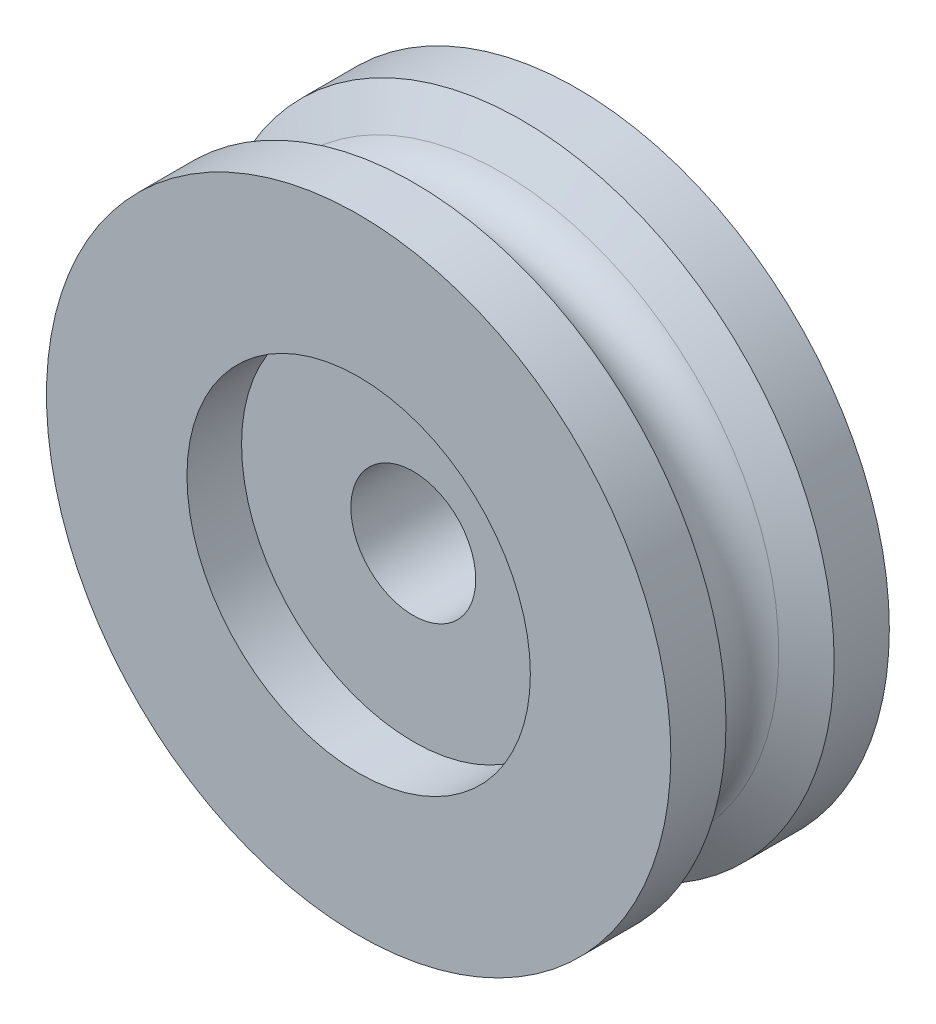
ISO-10303-21;
HEADER;
FILE_DESCRIPTION(('STEP AP214'),'2;1');
FILE_NAME('part.step','',(''),(''),'','','');
FILE_SCHEMA(('AUTOMOTIVE_DESIGN { 1 0 10303 214 1 1 1 1 }'));
ENDSEC;
DATA;
#1=APPLICATION_CONTEXT('core data for automotive mechanical design processes');
#2=APPLICATION_PROTOCOL_DEFINITION('international standard','automotive_design',2000,#1);
#3=PRODUCT_CONTEXT('',#1,'mechanical');
#4=PRODUCT('Part','Part','',(#3));
#5=PRODUCT_RELATED_PRODUCT_CATEGORY('part','',(#4));
#6=PRODUCT_DEFINITION_FORMATION('','',#4);
#7=PRODUCT_DEFINITION_CONTEXT('part definition',#1,'design');
#8=PRODUCT_DEFINITION('design','',#6,#7);
#9=PRODUCT_DEFINITION_SHAPE('','',#8);
#10=(LENGTH_UNIT() NAMED_UNIT(*) SI_UNIT(.MILLI.,.METRE.));
#11=(NAMED_UNIT(*) PLANE_ANGLE_UNIT() SI_UNIT($,.RADIAN.));
#12=(NAMED_UNIT(*) SI_UNIT($,.STERADIAN.) SOLID_ANGLE_UNIT());
#13=UNCERTAINTY_MEASURE_WITH_UNIT(LENGTH_MEASURE(1.E-05),#10,'distance_accuracy_value','');
#14=(GEOMETRIC_REPRESENTATION_CONTEXT(3) GLOBAL_UNCERTAINTY_ASSIGNED_CONTEXT((#13)) GLOBAL_UNIT_ASSIGNED_CONTEXT((#10,
#11,#12)) REPRESENTATION_CONTEXT('',''));
#15=CARTESIAN_POINT('',(0.,0.,0.));
#16=DIRECTION('',(0.,0.,1.));
#17=DIRECTION('',(1.,0.,0.));
#18=AXIS2_PLACEMENT_3D('',#15,#16,#17);
#19=CARTESIAN_POINT('',(0.,0.,-3.46410161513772));
#20=DIRECTION('',(0.,0.,-1.));
#21=DIRECTION('',(-1.,0.,0.));
#22=AXIS2_PLACEMENT_3D('',#19,#20,#21);
#23=CONICAL_SURFACE('',#22,20.,1.04719755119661);
#24=CARTESIAN_POINT('',(0.,0.,-2.16506350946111));
#25=DIRECTION('',(0.,0.,1.));
#26=DIRECTION('',(1.,0.,0.));
#27=AXIS2_PLACEMENT_3D('',#24,#25,#26);
#28=CIRCLE('',#27,17.75);
#29=CARTESIAN_POINT('',(17.75,0.,-2.16506350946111));
#30=VERTEX_POINT('',#29);
#31=EDGE_CURVE('E8',#30,#30,#28,.T.);
#32=ORIENTED_EDGE('',*,*,#31,.F.);
#33=EDGE_LOOP('',(#32));
#34=FACE_BOUND('',#33,.T.);
#35=CARTESIAN_POINT('',(0.,0.,-3.46410161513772));
#36=DIRECTION('',(0.,0.,1.));
#37=DIRECTION('',(1.,0.,0.));
#38=AXIS2_PLACEMENT_3D('',#35,#36,#37);
#39=CIRCLE('',#38,20.);
#40=CARTESIAN_POINT('',(20.,0.,-3.46410161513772));
#41=VERTEX_POINT('',#40);
#42=EDGE_CURVE('E52',#41,#41,#39,.T.);
#43=ORIENTED_EDGE('',*,*,#42,.T.);
#44=EDGE_LOOP('',(#43));
#45=FACE_BOUND('',#44,.T.);
#46=ADVANCED_FACE('F12',(#34,#45),#23,.T.);
#47=CARTESIAN_POINT('',(0.,0.,0.));
#48=DIRECTION('',(0.,0.,1.));
#49=DIRECTION('',(1.,0.,0.));
#50=AXIS2_PLACEMENT_3D('',#47,#48,#49);
#51=TOROIDAL_SURFACE('',#50,19.,2.5);
#52=CARTESIAN_POINT('',(0.,0.,2.16506350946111));
#53=DIRECTION('',(0.,0.,1.));
#54=DIRECTION('',(1.,0.,0.));
#55=AXIS2_PLACEMENT_3D('',#52,#53,#54);
#56=CIRCLE('',#55,17.75);
#57=CARTESIAN_POINT('',(17.75,0.,2.16506350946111));
#58=VERTEX_POINT('',#57);
#59=EDGE_CURVE('E18',#58,#58,#56,.T.);
#60=ORIENTED_EDGE('',*,*,#59,.F.);
#61=EDGE_LOOP('',(#60));
#62=FACE_BOUND('',#61,.T.);
#63=ORIENTED_EDGE('',*,*,#31,.T.);
#64=EDGE_LOOP('',(#63));
#65=FACE_BOUND('',#64,.T.);
#66=ADVANCED_FACE('F113',(#62,#65),#51,.F.);
#67=CARTESIAN_POINT('',(0.,0.,2.16506350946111));
#68=DIRECTION('',(0.,0.,1.));
#69=DIRECTION('',(1.,0.,0.));
#70=AXIS2_PLACEMENT_3D('',#67,#68,#69);
#71=CONICAL_SURFACE('',#70,17.75,1.04719755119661);
#72=CARTESIAN_POINT('',(0.,0.,3.46410161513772));
#73=DIRECTION('',(0.,0.,1.));
#74=DIRECTION('',(1.,0.,0.));
#75=AXIS2_PLACEMENT_3D('',#72,#73,#74);
#76=CIRCLE('',#75,20.);
#77=CARTESIAN_POINT('',(20.,0.,3.46410161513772));
#78=VERTEX_POINT('',#77);
#79=EDGE_CURVE('E22',#78,#78,#76,.T.);
#80=ORIENTED_EDGE('',*,*,#79,.F.);
#81=EDGE_LOOP('',(#80));
#82=FACE_BOUND('',#81,.T.);
#83=ORIENTED_EDGE('',*,*,#59,.T.);
#84=EDGE_LOOP('',(#83));
#85=FACE_BOUND('',#84,.T.);
#86=ADVANCED_FACE('F108',(#82,#85),#71,.T.);
#87=CARTESIAN_POINT('',(0.,0.,7.5891940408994));
#88=DIRECTION('',(0.,0.,1.));
#89=DIRECTION('',(1.,0.,0.));
#90=AXIS2_PLACEMENT_3D('',#87,#88,#89);
#91=CYLINDRICAL_SURFACE('',#90,20.);
#92=CARTESIAN_POINT('',(0.,0.,7.));
#93=DIRECTION('',(0.,0.,1.));
#94=DIRECTION('',(1.,0.,0.));
#95=AXIS2_PLACEMENT_3D('',#92,#93,#94);
#96=CIRCLE('',#95,20.);
#97=CARTESIAN_POINT('',(20.,0.,7.));
#98=VERTEX_POINT('',#97);
#99=EDGE_CURVE('E26',#98,#98,#96,.T.);
#100=ORIENTED_EDGE('',*,*,#99,.F.);
#101=EDGE_LOOP('',(#100));
#102=FACE_BOUND('',#101,.T.);
#103=ORIENTED_EDGE('',*,*,#79,.T.);
#104=EDGE_LOOP('',(#103));
#105=FACE_BOUND('',#104,.T.);
#106=ADVANCED_FACE('F102',(#102,#105),#91,.T.);
#107=CARTESIAN_POINT('',(0.,20.,7.));
#108=DIRECTION('',(0.,0.,-1.));
#109=DIRECTION('',(-1.,0.,0.));
#110=AXIS2_PLACEMENT_3D('',#107,#108,#109);
#111=PLANE('',#110);
#112=CARTESIAN_POINT('',(0.,0.,7.));
#113=DIRECTION('',(0.,0.,1.));
#114=DIRECTION('',(1.,0.,0.));
#115=AXIS2_PLACEMENT_3D('',#112,#113,#114);
#116=CIRCLE('',#115,11.);
#117=CARTESIAN_POINT('',(11.,0.,7.));
#118=VERTEX_POINT('',#117);
#119=EDGE_CURVE('E31',#118,#118,#116,.T.);
#120=ORIENTED_EDGE('',*,*,#119,.F.);
#121=EDGE_LOOP('',(#120));
#122=FACE_BOUND('',#121,.T.);
#123=ORIENTED_EDGE('',*,*,#99,.T.);
#124=EDGE_LOOP('',(#123));
#125=FACE_BOUND('',#124,.T.);
#126=ADVANCED_FACE('F96',(#122,#125),#111,.F.);
#127=CARTESIAN_POINT('',(0.,0.,7.5891940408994));
#128=DIRECTION('',(0.,0.,1.));
#129=DIRECTION('',(1.,0.,0.));
#130=AXIS2_PLACEMENT_3D('',#127,#128,#129);
#131=CYLINDRICAL_SURFACE('',#130,11.);
#132=CARTESIAN_POINT('',(0.,0.,3.5));
#133=DIRECTION('',(0.,0.,1.));
#134=DIRECTION('',(1.,0.,0.));
#135=AXIS2_PLACEMENT_3D('',#132,#133,#134);
#136=CIRCLE('',#135,11.);
#137=CARTESIAN_POINT('',(11.,0.,3.5));
#138=VERTEX_POINT('',#137);
#139=EDGE_CURVE('E34',#138,#138,#136,.T.);
#140=ORIENTED_EDGE('',*,*,#139,.F.);
#141=EDGE_LOOP('',(#140));
#142=FACE_BOUND('',#141,.T.);
#143=ORIENTED_EDGE('',*,*,#119,.T.);
#144=EDGE_LOOP('',(#143));
#145=FACE_BOUND('',#144,.T.);
#146=ADVANCED_FACE('F90',(#142,#145),#131,.F.);
#147=CARTESIAN_POINT('',(0.,11.,3.5));
#148=DIRECTION('',(0.,0.,-1.));
#149=DIRECTION('',(-1.,0.,0.));
#150=AXIS2_PLACEMENT_3D('',#147,#148,#149);
#151=PLANE('',#150);
#152=CARTESIAN_POINT('',(0.,0.,3.5));
#153=DIRECTION('',(0.,0.,1.));
#154=DIRECTION('',(1.,0.,0.));
#155=AXIS2_PLACEMENT_3D('',#152,#153,#154);
#156=CIRCLE('',#155,4.);
#157=CARTESIAN_POINT('',(4.,0.,3.5));
#158=VERTEX_POINT('',#157);
#159=EDGE_CURVE('E37',#158,#158,#156,.T.);
#160=ORIENTED_EDGE('',*,*,#159,.F.);
#161=EDGE_LOOP('',(#160));
#162=FACE_BOUND('',#161,.T.);
#163=ORIENTED_EDGE('',*,*,#139,.T.);
#164=EDGE_LOOP('',(#163));
#165=FACE_BOUND('',#164,.T.);
#166=ADVANCED_FACE('F84',(#162,#165),#151,.F.);
#167=CARTESIAN_POINT('',(0.,0.,7.5891940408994));
#168=DIRECTION('',(0.,0.,1.));
#169=DIRECTION('',(1.,0.,0.));
#170=AXIS2_PLACEMENT_3D('',#167,#168,#169);
#171=CYLINDRICAL_SURFACE('',#170,4.);
#172=CARTESIAN_POINT('',(0.,0.,-3.5));
#173=DIRECTION('',(0.,0.,1.));
#174=DIRECTION('',(1.,0.,0.));
#175=AXIS2_PLACEMENT_3D('',#172,#173,#174);
#176=CIRCLE('',#175,4.);
#177=CARTESIAN_POINT('',(4.,0.,-3.5));
#178=VERTEX_POINT('',#177);
#179=EDGE_CURVE('E40',#178,#178,#176,.T.);
#180=ORIENTED_EDGE('',*,*,#179,.F.);
#181=EDGE_LOOP('',(#180));
#182=FACE_BOUND('',#181,.T.);
#183=ORIENTED_EDGE('',*,*,#159,.T.);
#184=EDGE_LOOP('',(#183));
#185=FACE_BOUND('',#184,.T.);
#186=ADVANCED_FACE('F78',(#182,#185),#171,.F.);
#187=CARTESIAN_POINT('',(0.,4.,-3.5));
#188=DIRECTION('',(0.,0.,1.));
#189=DIRECTION('',(1.,0.,0.));
#190=AXIS2_PLACEMENT_3D('',#187,#188,#189);
#191=PLANE('',#190);
#192=CARTESIAN_POINT('',(0.,0.,-3.5));
#193=DIRECTION('',(0.,0.,1.));
#194=DIRECTION('',(1.,0.,0.));
#195=AXIS2_PLACEMENT_3D('',#192,#193,#194);
#196=CIRCLE('',#195,9.);
#197=CARTESIAN_POINT('',(9.,0.,-3.5));
#198=VERTEX_POINT('',#197);
#199=EDGE_CURVE('E43',#198,#198,#196,.T.);
#200=ORIENTED_EDGE('',*,*,#199,.F.);
#201=EDGE_LOOP('',(#200));
#202=FACE_BOUND('',#201,.T.);
#203=ORIENTED_EDGE('',*,*,#179,.T.);
#204=EDGE_LOOP('',(#203));
#205=FACE_BOUND('',#204,.T.);
#206=ADVANCED_FACE('F72',(#202,#205),#191,.F.);
#207=CARTESIAN_POINT('',(0.,0.,7.5891940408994));
#208=DIRECTION('',(0.,0.,1.));
#209=DIRECTION('',(1.,0.,0.));
#210=AXIS2_PLACEMENT_3D('',#207,#208,#209);
#211=CYLINDRICAL_SURFACE('',#210,9.);
#212=CARTESIAN_POINT('',(0.,0.,-7.));
#213=DIRECTION('',(0.,0.,1.));
#214=DIRECTION('',(1.,0.,0.));
#215=AXIS2_PLACEMENT_3D('',#212,#213,#214);
#216=CIRCLE('',#215,9.);
#217=CARTESIAN_POINT('',(9.,0.,-7.));
#218=VERTEX_POINT('',#217);
#219=EDGE_CURVE('E46',#218,#218,#216,.T.);
#220=ORIENTED_EDGE('',*,*,#219,.F.);
#221=EDGE_LOOP('',(#220));
#222=FACE_BOUND('',#221,.T.);
#223=ORIENTED_EDGE('',*,*,#199,.T.);
#224=EDGE_LOOP('',(#223));
#225=FACE_BOUND('',#224,.T.);
#226=ADVANCED_FACE('F66',(#222,#225),#211,.F.);
#227=CARTESIAN_POINT('',(0.,9.,-7.));
#228=DIRECTION('',(0.,0.,1.));
#229=DIRECTION('',(1.,0.,0.));
#230=AXIS2_PLACEMENT_3D('',#227,#228,#229);
#231=PLANE('',#230);
#232=CARTESIAN_POINT('',(0.,0.,-7.));
#233=DIRECTION('',(0.,0.,1.));
#234=DIRECTION('',(1.,0.,0.));
#235=AXIS2_PLACEMENT_3D('',#232,#233,#234);
#236=CIRCLE('',#235,20.);
#237=CARTESIAN_POINT('',(20.,0.,-7.));
#238=VERTEX_POINT('',#237);
#239=EDGE_CURVE('E49',#238,#238,#236,.T.);
#240=ORIENTED_EDGE('',*,*,#239,.F.);
#241=EDGE_LOOP('',(#240));
#242=FACE_BOUND('',#241,.T.);
#243=ORIENTED_EDGE('',*,*,#219,.T.);
#244=EDGE_LOOP('',(#243));
#245=FACE_BOUND('',#244,.T.);
#246=ADVANCED_FACE('F60',(#242,#245),#231,.F.);
#247=CARTESIAN_POINT('',(0.,0.,7.5891940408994));
#248=DIRECTION('',(0.,0.,1.));
#249=DIRECTION('',(1.,0.,0.));
#250=AXIS2_PLACEMENT_3D('',#247,#248,#249);
#251=CYLINDRICAL_SURFACE('',#250,20.);
#252=ORIENTED_EDGE('',*,*,#42,.F.);
#253=EDGE_LOOP('',(#252));
#254=FACE_BOUND('',#253,.T.);
#255=ORIENTED_EDGE('',*,*,#239,.T.);
#256=EDGE_LOOP('',(#255));
#257=FACE_BOUND('',#256,.T.);
#258=ADVANCED_FACE('F57',(#254,#257),#251,.T.);
#259=CLOSED_SHELL('',(#46,#66,#86,#106,#126,#146,#166,#186,#206,#226,#246,#258));
#260=MANIFOLD_SOLID_BREP('B1',#259);
#261=ADVANCED_BREP_SHAPE_REPRESENTATION('',(#18,#260),#14);
#262=SHAPE_DEFINITION_REPRESENTATION(#9,#261);
ENDSEC;
END-ISO-10303-21;
